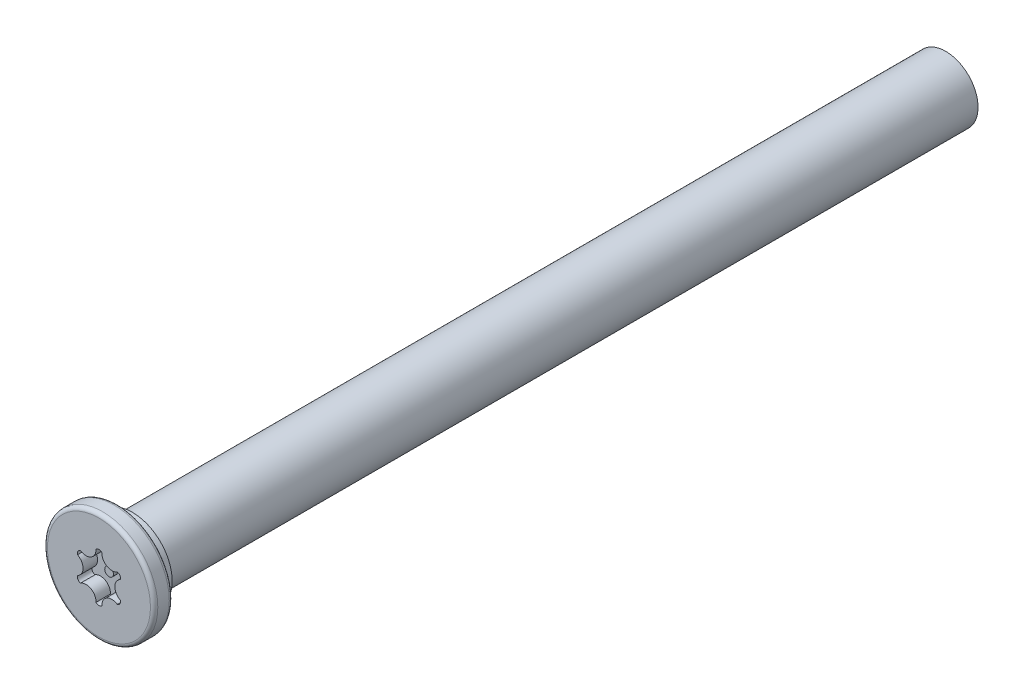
from build123d import *

# Parameters (mm, degrees)
SKETCH2_W           = 1.3
SKETCH2_H           = 3.81
SKETCH2_W_2         = 12.7
SKETCH2_H_2         = 2.23
CUT_EXTRUDE3_DEPTH  = 1
FILLET12_R          = 0.254
CUT_EXTRUDE6_START  = -12.7
SKETCH7_R           = 2.23
CUT_EXTRUDE6_DEPTH  = 12.7
SKETCH11_R          = 2.738000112
SKETCH11_R_2        = 2.230000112
BOSS_EXTRUDE1_DEPTH = 1.016
SKETCH12_R          = 2.230000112
BOSS_EXTRUDE2_DEPTH = 12.7
SKETCH14_R          = 0.3
BOSS_EXTRUDE4_DEPTH = 0.3
CUT_EXTRUDE7_START  = -12.7
SKETCH15_R          = 2.230000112
CUT_EXTRUDE7_DEPTH  = 12.7
SKETCH16_R          = 2.230000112
BOSS_EXTRUDE5_DEPTH = 57.15


with BuildPart() as part:
    # Sketch2 → Revolve1 (revolve)
    with BuildSketch(Plane(origin=(0, 0, 0), x_dir=(0, 0, -1), z_dir=(1, 0, 0)), mode=Mode.PRIVATE) as revolve1_sk:
        with Locations((0.65, 1.905)):
            Rectangle(SKETCH2_W, SKETCH2_H)
        with Locations((7.65, 1.115)):
            Rectangle(SKETCH2_W_2, SKETCH2_H_2)
    revolve(revolve1_sk.sketch.rotate(Axis((0, 0, -1.3), (0, 0, -1)), 90), axis=Axis((0, 0, -1.3), (0, 0, -1)))

    # Sketch3 → Cut-Extrude3 (cut)
    with BuildSketch(Plane.XY):
        with BuildLine():
            ThreePointArc((-0.205060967, 1.589373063), (0, 1.674312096), (0.205060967, 1.589373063))
            ThreePointArc((0.205060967, 1.589373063), (0.54882888, 0.950599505), (1.273906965, 0.972274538))
            ThreePointArc((1.273906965, 0.972274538), (1.449996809, 0.837156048), (1.478967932, 0.617098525))
            ThreePointArc((1.478967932, 0.617098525), (1.097657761, 0), (1.478967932, -0.617098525))
            ThreePointArc((1.478967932, -0.617098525), (1.449996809, -0.837156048), (1.273906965, -0.972274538))
            ThreePointArc((1.273906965, -0.972274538), (0.54882888, -0.950599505), (0.205060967, -1.589373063))
            ThreePointArc((0.205060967, -1.589373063), (0, -1.674312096), (-0.205060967, -1.589373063))
            ThreePointArc((-0.205060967, -1.589373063), (-0.54882888, -0.950599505), (-1.273906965, -0.972274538))
            ThreePointArc((-1.273906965, -0.972274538), (-1.449996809, -0.837156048), (-1.478967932, -0.617098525))
            ThreePointArc((-1.478967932, -0.617098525), (-1.097657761, 0), (-1.478967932, 0.617098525))
            ThreePointArc((-1.478967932, 0.617098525), (-1.449996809, 0.837156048), (-1.273906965, 0.972274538))
            ThreePointArc((-1.273906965, 0.972274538), (-0.54882888, 0.950599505), (-0.205060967, 1.589373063))
        make_face()
    extrude(amount=-CUT_EXTRUDE3_DEPTH, mode=Mode.SUBTRACT)

    # Fillet12
    fillet12_edges = [part.edges().sort_by_distance(p)[0] for p in [
        (-3.81, 0, 0),
        (-3.81, 0, -1.3),
    ]]
    fillet(fillet12_edges, radius=FILLET12_R)

    # Sketch7 → Cut-Extrude6 (cut)
    with BuildSketch(Plane(origin=(0, 0, -14), x_dir=(-1, 0, 0), z_dir=(0, 0, -1)).offset(CUT_EXTRUDE6_START)):
        Circle(SKETCH7_R)
    extrude(amount=CUT_EXTRUDE6_DEPTH, mode=Mode.SUBTRACT)

    # Sketch11 → Boss-Extrude1 (add)
    with BuildSketch(Plane(origin=(0, 0, -1.3), x_dir=(-1, 0, 0), z_dir=(0, 0, -1))):
        with Locations(Location((0, 0, 0), (0, 0, 180))):
            Circle(SKETCH11_R)
        Circle(SKETCH11_R_2, mode=Mode.SUBTRACT)
    extrude(amount=BOSS_EXTRUDE1_DEPTH)

    # Sketch12 → Boss-Extrude2 (add)
    with BuildSketch(Plane(origin=(0, 0, -1.3), x_dir=(-1, 0, 0), z_dir=(0, 0, -1))):
        Circle(SKETCH12_R)
    extrude(amount=BOSS_EXTRUDE2_DEPTH)

    # Sketch14 → Boss-Extrude4 (add)
    with BuildSketch(Plane.XY.offset(-1)):
        Circle(SKETCH14_R)
    extrude(amount=BOSS_EXTRUDE4_DEPTH)

    # Sketch15 → Cut-Extrude7 (cut)
    with BuildSketch(Plane(origin=(0, 0, -14), x_dir=(-1, 0, 0), z_dir=(0, 0, -1)).offset(CUT_EXTRUDE7_START)):
        Circle(SKETCH15_R)
    extrude(amount=CUT_EXTRUDE7_DEPTH, mode=Mode.SUBTRACT)

    # Sketch16 → Boss-Extrude5 (add)
    with BuildSketch(Plane(origin=(0, 0, -1.3), x_dir=(-1, 0, 0), z_dir=(0, 0, -1))):
        Circle(SKETCH16_R)
    extrude(amount=BOSS_EXTRUDE5_DEPTH)


solid = part.part
